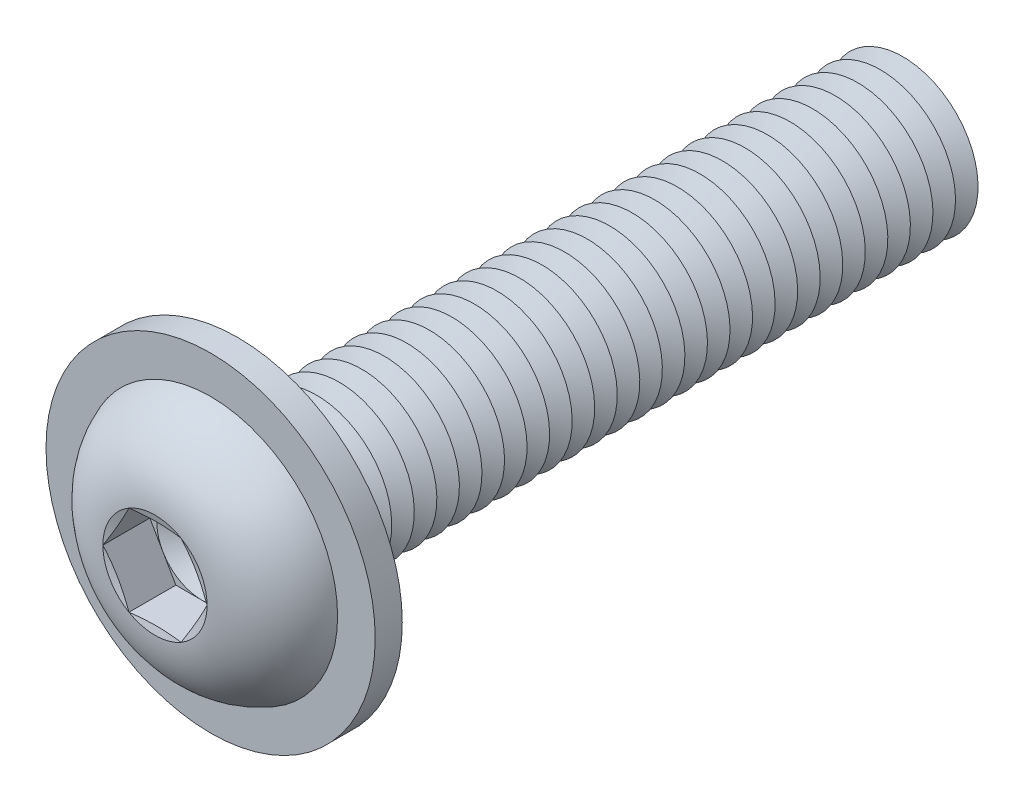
from build123d import *

# Parameters (mm, degrees)
FILLET1_R           = 0.75
LPATTERN1_COUNT     = 30
LPATTERN1_PITCH     = 1.5
CUT_EXTRUDE1_DEPTH  = 3.12
SKETCH5_R           = 10.95
SKETCH5_R_2         = 5.75
BOSS_EXTRUDE1_DEPTH = 1.8


with BuildPart() as part:
    # Sketch1 → Revolve1 (revolve)
    with BuildSketch(Plane(origin=(0, 0, 0), x_dir=(0, 0, -1), z_dir=(1, 0, 0))):
        with BuildLine():
            Line((0, 5), (0, 8.75))
            ThreePointArc((0, 8.75), (-3.814142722, 7.21429474), (-5.5, 3.4641))
            Line((-5.5, 3.4641), (-5.035898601, 1.73205))
            Line((-5.035898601, 1.73205), (-5.5, 1.73205))
            Line((-5.5, 1.73205), (-5.5, 0))
            Line((-5.5, 0), (45, 0))
            Line((45, 0), (45, 5))
            Line((45, 5), (0, 5))
        make_face()
    revolve(axis=Axis((0, 0, -45), (0, 0, 1)))

    # Fillet1
    fillet1_edges = [part.edges().sort_by_distance(p)[0] for p in [
        (0, -5, 0),
    ]]
    fillet(fillet1_edges, radius=FILLET1_R)

    # Sketch2 → Cut-Revolve1 (revolve, cut)
    with BuildSketch(Plane(origin=(0, 0, 0), x_dir=(0, 0, -1), z_dir=(1, 0, 0))):
        Polygon((44.25, 5), (45.75, 5), (45, 3.700961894), align=None)
    cut_revolve1 = revolve(axis=Axis((0, 0, -45), (0, 0, -1)), mode=Mode.SUBTRACT)

    # LPattern1: Cut-Revolve1 ×30
    with Locations(*[(0, 0, i * LPATTERN1_PITCH) for i in range(1, LPATTERN1_COUNT)]):
        add(cut_revolve1, mode=Mode.SUBTRACT)

    # Sketch3 → Cut-Extrude1 (cut)
    with BuildSketch(Plane.XY.offset(5.5)):
        Polygon((1.73205, 2.999998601), (-1.73205, 2.999998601), (-3.4641, 0), (-1.73205, -2.999998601), (1.73205, -2.999998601), (3.4641, 0), align=None)
    extrude(amount=-CUT_EXTRUDE1_DEPTH, mode=Mode.SUBTRACT)

    # Cut-Extrude2 cone 1 section (on through the dimple's axis) → Cut-Extrude2 (revolve, cut)
    with BuildSketch(Plane(origin=(0, 0, 2.38), x_dir=(0, -1, 0), z_dir=(1, 0, 0))):
        Polygon((0, 0), (2.999998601, 0), (0, 1.73205), align=None)
    revolve(axis=Axis((0, 0, 2.38), (0, 0, -1)), mode=Mode.SUBTRACT)

    # Sketch5 → Boss-Extrude1 (add)
    with BuildSketch(Plane(origin=(0, 0, 0), x_dir=(-1, 0, 0), z_dir=(0, 0, -1))):
        with Locations(Location((0, 0, 0), (0, 0, 90))):
            Circle(SKETCH5_R)
        Circle(SKETCH5_R_2, mode=Mode.SUBTRACT)
    extrude(amount=-BOSS_EXTRUDE1_DEPTH)


solid = part.part
